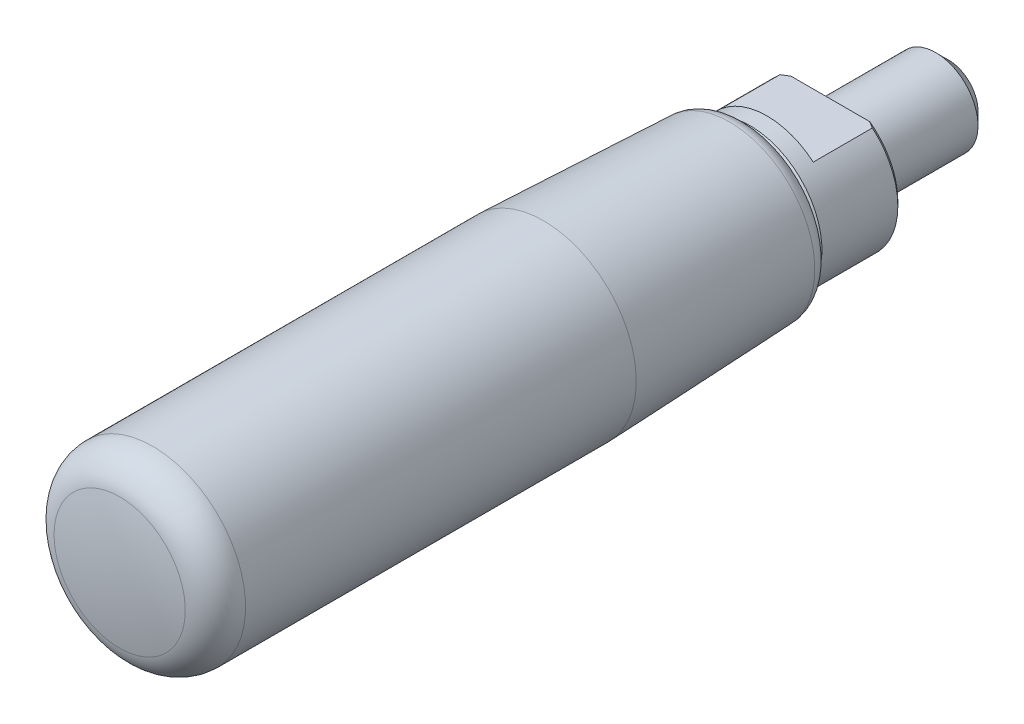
ISO-10303-21;
HEADER;
FILE_DESCRIPTION(('STEP AP214'),'2;1');
FILE_NAME('part.step','',(''),(''),'','','');
FILE_SCHEMA(('AUTOMOTIVE_DESIGN { 1 0 10303 214 1 1 1 1 }'));
ENDSEC;
DATA;
#1=APPLICATION_CONTEXT('core data for automotive mechanical design processes');
#2=APPLICATION_PROTOCOL_DEFINITION('international standard','automotive_design',2000,#1);
#3=PRODUCT_CONTEXT('',#1,'mechanical');
#4=PRODUCT('Part','Part','',(#3));
#5=PRODUCT_RELATED_PRODUCT_CATEGORY('part','',(#4));
#6=PRODUCT_DEFINITION_FORMATION('','',#4);
#7=PRODUCT_DEFINITION_CONTEXT('part definition',#1,'design');
#8=PRODUCT_DEFINITION('design','',#6,#7);
#9=PRODUCT_DEFINITION_SHAPE('','',#8);
#10=(LENGTH_UNIT() NAMED_UNIT(*) SI_UNIT(.MILLI.,.METRE.));
#11=(NAMED_UNIT(*) PLANE_ANGLE_UNIT() SI_UNIT($,.RADIAN.));
#12=(NAMED_UNIT(*) SI_UNIT($,.STERADIAN.) SOLID_ANGLE_UNIT());
#13=UNCERTAINTY_MEASURE_WITH_UNIT(LENGTH_MEASURE(1.E-05),#10,'distance_accuracy_value','');
#14=(GEOMETRIC_REPRESENTATION_CONTEXT(3) GLOBAL_UNCERTAINTY_ASSIGNED_CONTEXT((#13)) GLOBAL_UNIT_ASSIGNED_CONTEXT((#10,
#11,#12)) REPRESENTATION_CONTEXT('',''));
#15=CARTESIAN_POINT('',(0.,0.,0.));
#16=DIRECTION('',(0.,0.,1.));
#17=DIRECTION('',(1.,0.,0.));
#18=AXIS2_PLACEMENT_3D('',#15,#16,#17);
#19=CARTESIAN_POINT('',(0.,0.,-19.));
#20=DIRECTION('',(0.,0.,-1.));
#21=DIRECTION('',(-1.,0.,0.));
#22=AXIS2_PLACEMENT_3D('',#19,#20,#21);
#23=CYLINDRICAL_SURFACE('',#22,8.5);
#24=CARTESIAN_POINT('',(0.,0.,9.5));
#25=DIRECTION('',(0.,0.,-1.));
#26=DIRECTION('',(-1.,0.,0.));
#27=AXIS2_PLACEMENT_3D('',#24,#25,#26);
#28=CIRCLE('',#27,8.5);
#29=CARTESIAN_POINT('',(-8.49999999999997,0.,9.50000000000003));
#30=VERTEX_POINT('',#29);
#31=EDGE_CURVE('E113',#30,#30,#28,.T.);
#32=ORIENTED_EDGE('',*,*,#31,.T.);
#33=EDGE_LOOP('',(#32));
#34=FACE_BOUND('',#33,.T.);
#35=CARTESIAN_POINT('',(0.,0.,0.5));
#36=DIRECTION('',(0.,0.,-1.));
#37=DIRECTION('',(-1.,0.,0.));
#38=AXIS2_PLACEMENT_3D('',#35,#36,#37);
#39=CIRCLE('',#38,8.5);
#40=CARTESIAN_POINT('',(-5.47722557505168,-6.5,0.500000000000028));
#41=VERTEX_POINT('',#40);
#42=CARTESIAN_POINT('',(-5.47722557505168,6.5,0.500000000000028));
#43=VERTEX_POINT('',#42);
#44=EDGE_CURVE('E118',#41,#43,#39,.T.);
#45=ORIENTED_EDGE('',*,*,#44,.F.);
#46=DIRECTION('',(0.,0.,-1.));
#47=VECTOR('',#46,1.);
#48=CARTESIAN_POINT('',(-5.47722557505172,-6.5,-19.));
#49=LINE('',#48,#47);
#50=CARTESIAN_POINT('',(-5.47722557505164,-6.5,7.5));
#51=VERTEX_POINT('',#50);
#52=EDGE_CURVE('E78',#41,#51,#49,.F.);
#53=ORIENTED_EDGE('',*,*,#52,.T.);
#54=CARTESIAN_POINT('',(0.,0.,7.5));
#55=DIRECTION('',(0.,0.,1.));
#56=DIRECTION('',(1.,0.,0.));
#57=AXIS2_PLACEMENT_3D('',#54,#55,#56);
#58=CIRCLE('',#57,8.5);
#59=CARTESIAN_POINT('',(5.47722557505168,-6.5,7.5));
#60=VERTEX_POINT('',#59);
#61=EDGE_CURVE('E82',#60,#51,#58,.F.);
#62=ORIENTED_EDGE('',*,*,#61,.F.);
#63=DIRECTION('',(0.,0.,-1.));
#64=VECTOR('',#63,1.);
#65=CARTESIAN_POINT('',(5.4772255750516,-6.5,-19.));
#66=LINE('',#65,#64);
#67=CARTESIAN_POINT('',(5.47722557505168,-6.5,0.499999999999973));
#68=VERTEX_POINT('',#67);
#69=EDGE_CURVE('E67',#60,#68,#66,.T.);
#70=ORIENTED_EDGE('',*,*,#69,.T.);
#71=CARTESIAN_POINT('',(5.47722557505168,6.5,0.499999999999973));
#72=VERTEX_POINT('',#71);
#73=EDGE_CURVE('E116',#72,#68,#39,.T.);
#74=ORIENTED_EDGE('',*,*,#73,.F.);
#75=DIRECTION('',(0.,0.,-1.));
#76=VECTOR('',#75,1.);
#77=CARTESIAN_POINT('',(5.4772255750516,6.5,-19.));
#78=LINE('',#77,#76);
#79=CARTESIAN_POINT('',(5.47722557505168,6.5,7.5));
#80=VERTEX_POINT('',#79);
#81=EDGE_CURVE('E128',#80,#72,#78,.T.);
#82=ORIENTED_EDGE('',*,*,#81,.F.);
#83=CARTESIAN_POINT('',(0.,0.,7.5));
#84=DIRECTION('',(0.,0.,-1.));
#85=DIRECTION('',(-1.,0.,0.));
#86=AXIS2_PLACEMENT_3D('',#83,#84,#85);
#87=CIRCLE('',#86,8.5);
#88=CARTESIAN_POINT('',(-5.47722557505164,6.5,7.5));
#89=VERTEX_POINT('',#88);
#90=EDGE_CURVE('E88',#80,#89,#87,.F.);
#91=ORIENTED_EDGE('',*,*,#90,.T.);
#92=DIRECTION('',(0.,0.,-1.));
#93=VECTOR('',#92,1.);
#94=CARTESIAN_POINT('',(-5.47722557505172,6.5,-19.));
#95=LINE('',#94,#93);
#96=EDGE_CURVE('E126',#43,#89,#95,.F.);
#97=ORIENTED_EDGE('',*,*,#96,.F.);
#98=EDGE_LOOP('',(#45,#53,#62,#70,#74,#82,#91,#97));
#99=FACE_BOUND('',#98,.T.);
#100=ADVANCED_FACE('F14',(#34,#99),#23,.T.);
#101=CARTESIAN_POINT('',(0.,0.,0.5));
#102=DIRECTION('',(0.,0.,1.));
#103=DIRECTION('',(1.,0.,0.));
#104=AXIS2_PLACEMENT_3D('',#101,#102,#103);
#105=CONICAL_SURFACE('',#104,8.5,0.785398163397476);
#106=CARTESIAN_POINT('',(2.1470979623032,-6.5,-1.15456139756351));
#107=CARTESIAN_POINT('',(2.32011125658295,-6.5,-1.10028095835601));
#108=CARTESIAN_POINT('',(2.49136126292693,-6.5,-1.04066633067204));
#109=CARTESIAN_POINT('',(2.83024122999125,-6.5,-0.912289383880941));
#110=CARTESIAN_POINT('',(2.99787420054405,-6.5,-0.84353504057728));
#111=CARTESIAN_POINT('',(3.32910847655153,-6.5,-0.698570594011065));
#112=CARTESIAN_POINT('',(3.49272247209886,-6.5,-0.622389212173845));
#113=CARTESIAN_POINT('',(3.81680773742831,-6.5,-0.463549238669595));
#114=CARTESIAN_POINT('',(3.9772782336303,-6.5,-0.380889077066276));
#115=CARTESIAN_POINT('',(4.45207454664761,-6.5,-0.126006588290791));
#116=CARTESIAN_POINT('',(4.76212657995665,-6.5,0.0541773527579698));
#117=CARTESIAN_POINT('',(5.3731437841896,-6.5,0.429866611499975));
#118=CARTESIAN_POINT('',(5.6740980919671,-6.5,0.625389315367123));
#119=CARTESIAN_POINT('',(6.1491269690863,-6.5,0.946770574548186));
#120=CARTESIAN_POINT('',(6.32562450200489,-6.5,1.06907697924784));
#121=CARTESIAN_POINT('',(6.67625920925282,-6.5,1.31703136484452));
#122=CARTESIAN_POINT('',(6.85039634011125,-6.5,1.44267940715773));
#123=CARTESIAN_POINT('',(7.36977452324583,-6.5,1.82385228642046));
#124=CARTESIAN_POINT('',(7.71193535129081,-6.5,2.08357365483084));
#125=CARTESIAN_POINT('',(8.39004451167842,-6.5,2.61120239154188));
#126=CARTESIAN_POINT('',(8.72599049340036,-6.5,2.87911275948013));
#127=CARTESIAN_POINT('',(9.39294734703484,-6.5,3.42101971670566));
#128=CARTESIAN_POINT('',(9.72395802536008,-6.5,3.6950165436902));
#129=CARTESIAN_POINT('',(10.3877110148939,-6.5,4.25240968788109));
#130=CARTESIAN_POINT('',(10.7203854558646,-6.5,4.53588661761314));
#131=CARTESIAN_POINT('',(11.3825001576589,-6.5,5.10660843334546));
#132=CARTESIAN_POINT('',(11.7119403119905,-6.5,5.39385344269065));
#133=CARTESIAN_POINT('',(12.3675196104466,-6.5,5.97072932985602));
#134=CARTESIAN_POINT('',(12.6936641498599,-6.5,6.26035408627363));
#135=CARTESIAN_POINT('',(13.3437591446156,-6.5,6.84200684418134));
#136=CARTESIAN_POINT('',(13.6677097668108,-6.5,7.13403465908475));
#137=CARTESIAN_POINT('',(13.9907991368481,-6.5,7.42700426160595));
#138=B_SPLINE_CURVE_WITH_KNOTS('',3,(#106,#107,#108,#109,#110,#111,#112,#113,#114,#115,#116,
#117,#118,#119,#120,#121,#122,#123,#124,#125,#126,#127,#128,#129,#130,#131,#132,#133,#134,#135,
#136,#137),.UNSPECIFIED.,.F.,.F.,(4,2,2,2,2,2,2,2,2,2,2,2,2,2,2,4),(0.,0.543774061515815,
1.08707667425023,1.62835584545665,2.16976658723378,3.24489626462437,4.32126269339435,
4.96542355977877,5.60959627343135,6.89811259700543,8.18710669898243,9.47615122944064,
10.787330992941,12.0985537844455,13.4070800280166,14.7155056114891),.UNSPECIFIED.);
#139=CARTESIAN_POINT('',(4.66368952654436,-6.5,0.));
#140=VERTEX_POINT('',#139);
#141=EDGE_CURVE('E73',#140,#68,#138,.T.);
#142=ORIENTED_EDGE('',*,*,#141,.F.);
#143=CARTESIAN_POINT('',(0.,0.,0.));
#144=DIRECTION('',(0.,0.,-1.));
#145=DIRECTION('',(-1.,0.,0.));
#146=AXIS2_PLACEMENT_3D('',#143,#144,#145);
#147=CIRCLE('',#146,8.);
#148=CARTESIAN_POINT('',(4.66368952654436,6.5,0.));
#149=VERTEX_POINT('',#148);
#150=EDGE_CURVE('E119',#149,#140,#147,.T.);
#151=ORIENTED_EDGE('',*,*,#150,.F.);
#152=CARTESIAN_POINT('',(2.1470979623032,6.5,-1.15456139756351));
#153=CARTESIAN_POINT('',(2.32011125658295,6.5,-1.10028095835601));
#154=CARTESIAN_POINT('',(2.49136126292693,6.5,-1.04066633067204));
#155=CARTESIAN_POINT('',(2.83024122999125,6.5,-0.912289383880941));
#156=CARTESIAN_POINT('',(2.99787420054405,6.5,-0.84353504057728));
#157=CARTESIAN_POINT('',(3.32910847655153,6.5,-0.698570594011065));
#158=CARTESIAN_POINT('',(3.49272247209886,6.5,-0.622389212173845));
#159=CARTESIAN_POINT('',(3.81680773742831,6.5,-0.463549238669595));
#160=CARTESIAN_POINT('',(3.9772782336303,6.5,-0.380889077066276));
#161=CARTESIAN_POINT('',(4.45207454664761,6.5,-0.126006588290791));
#162=CARTESIAN_POINT('',(4.76212657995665,6.5,0.0541773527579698));
#163=CARTESIAN_POINT('',(5.3731437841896,6.5,0.429866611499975));
#164=CARTESIAN_POINT('',(5.6740980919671,6.5,0.625389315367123));
#165=CARTESIAN_POINT('',(6.1491269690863,6.5,0.946770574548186));
#166=CARTESIAN_POINT('',(6.32562450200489,6.5,1.06907697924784));
#167=CARTESIAN_POINT('',(6.67625920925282,6.5,1.31703136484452));
#168=CARTESIAN_POINT('',(6.85039634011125,6.5,1.44267940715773));
#169=CARTESIAN_POINT('',(7.36977452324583,6.5,1.82385228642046));
#170=CARTESIAN_POINT('',(7.71193535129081,6.5,2.08357365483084));
#171=CARTESIAN_POINT('',(8.39004451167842,6.5,2.61120239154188));
#172=CARTESIAN_POINT('',(8.72599049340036,6.5,2.87911275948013));
#173=CARTESIAN_POINT('',(9.39294734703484,6.5,3.42101971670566));
#174=CARTESIAN_POINT('',(9.72395802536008,6.5,3.6950165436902));
#175=CARTESIAN_POINT('',(10.3877110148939,6.5,4.25240968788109));
#176=CARTESIAN_POINT('',(10.7203854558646,6.5,4.53588661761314));
#177=CARTESIAN_POINT('',(11.3825001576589,6.5,5.10660843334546));
#178=CARTESIAN_POINT('',(11.7119403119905,6.5,5.39385344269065));
#179=CARTESIAN_POINT('',(12.3675196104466,6.5,5.97072932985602));
#180=CARTESIAN_POINT('',(12.6936641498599,6.5,6.26035408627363));
#181=CARTESIAN_POINT('',(13.3437591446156,6.5,6.84200684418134));
#182=CARTESIAN_POINT('',(13.6677097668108,6.5,7.13403465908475));
#183=CARTESIAN_POINT('',(13.9907991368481,6.5,7.42700426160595));
#184=B_SPLINE_CURVE_WITH_KNOTS('',3,(#152,#153,#154,#155,#156,#157,#158,#159,#160,#161,#162,
#163,#164,#165,#166,#167,#168,#169,#170,#171,#172,#173,#174,#175,#176,#177,#178,#179,#180,#181,
#182,#183),.UNSPECIFIED.,.F.,.F.,(4,2,2,2,2,2,2,2,2,2,2,2,2,2,2,4),(0.,0.543774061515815,
1.08707667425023,1.62835584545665,2.16976658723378,3.24489626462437,4.32126269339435,
4.96542355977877,5.60959627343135,6.89811259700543,8.18710669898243,9.47615122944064,
10.787330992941,12.0985537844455,13.4070800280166,14.7155056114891),.UNSPECIFIED.);
#185=EDGE_CURVE('E37',#149,#72,#184,.T.);
#186=ORIENTED_EDGE('',*,*,#185,.T.);
#187=ORIENTED_EDGE('',*,*,#73,.T.);
#188=EDGE_LOOP('',(#142,#151,#186,#187));
#189=FACE_BOUND('',#188,.T.);
#190=ADVANCED_FACE('F143',(#189),#105,.T.);
#191=CARTESIAN_POINT('',(-13.9907991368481,-6.5,7.427004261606));
#192=CARTESIAN_POINT('',(-13.6677097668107,-6.5,7.13403465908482));
#193=CARTESIAN_POINT('',(-13.3437591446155,-6.5,6.84200684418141));
#194=CARTESIAN_POINT('',(-12.6936641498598,-6.5,6.2603540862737));
#195=CARTESIAN_POINT('',(-12.3675196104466,-6.5,5.97072932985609));
#196=CARTESIAN_POINT('',(-11.7119403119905,-6.5,5.39385344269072));
#197=CARTESIAN_POINT('',(-11.3825001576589,-6.5,5.10660843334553));
#198=CARTESIAN_POINT('',(-10.7203854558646,-6.5,4.53588661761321));
#199=CARTESIAN_POINT('',(-10.3877110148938,-6.5,4.25240968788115));
#200=CARTESIAN_POINT('',(-9.72395802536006,-6.5,3.69501654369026));
#201=CARTESIAN_POINT('',(-9.39294734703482,-6.5,3.42101971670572));
#202=CARTESIAN_POINT('',(-8.72599049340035,-6.5,2.87911275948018));
#203=CARTESIAN_POINT('',(-8.39004451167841,-6.5,2.61120239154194));
#204=CARTESIAN_POINT('',(-7.71193535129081,-6.5,2.08357365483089));
#205=CARTESIAN_POINT('',(-7.36977452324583,-6.5,1.82385228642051));
#206=CARTESIAN_POINT('',(-6.85039634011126,-6.5,1.44267940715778));
#207=CARTESIAN_POINT('',(-6.67625920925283,-6.5,1.31703136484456));
#208=CARTESIAN_POINT('',(-6.3256245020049,-6.5,1.06907697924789));
#209=CARTESIAN_POINT('',(-6.14912696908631,-6.5,0.946770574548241));
#210=CARTESIAN_POINT('',(-5.67409809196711,-6.5,0.625389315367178));
#211=CARTESIAN_POINT('',(-5.37314378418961,-6.5,0.42986661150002));
#212=CARTESIAN_POINT('',(-4.76212657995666,-6.5,0.0541773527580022));
#213=CARTESIAN_POINT('',(-4.45207454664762,-6.5,-0.12600658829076));
#214=CARTESIAN_POINT('',(-3.97727823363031,-6.5,-0.380889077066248));
#215=CARTESIAN_POINT('',(-3.81680773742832,-6.5,-0.463549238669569));
#216=CARTESIAN_POINT('',(-3.49272247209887,-6.5,-0.622389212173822));
#217=CARTESIAN_POINT('',(-3.32910847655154,-6.5,-0.698570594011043));
#218=CARTESIAN_POINT('',(-2.99787420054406,-6.5,-0.843535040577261));
#219=CARTESIAN_POINT('',(-2.83024122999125,-6.5,-0.912289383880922));
#220=CARTESIAN_POINT('',(-2.49136126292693,-6.5,-1.04066633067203));
#221=CARTESIAN_POINT('',(-2.32011125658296,-6.5,-1.100280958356));
#222=CARTESIAN_POINT('',(-2.14709796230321,-6.5,-1.15456139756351));
#223=B_SPLINE_CURVE_WITH_KNOTS('',3,(#191,#192,#193,#194,#195,#196,#197,#198,#199,#200,#201,
#202,#203,#204,#205,#206,#207,#208,#209,#210,#211,#212,#213,#214,#215,#216,#217,#218,#219,#220,
#221,#222),.UNSPECIFIED.,.F.,.F.,(4,2,2,2,2,2,2,2,2,2,2,2,2,2,2,4),(0.,1.30842558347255,
2.61695182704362,3.92817461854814,5.23935438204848,6.5283989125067,7.81739301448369,
9.10590933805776,9.75008205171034,10.3942429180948,11.4706093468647,12.5457390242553,
13.0871497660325,13.6284289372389,14.1717315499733,14.7155056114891),.UNSPECIFIED.);
#224=CARTESIAN_POINT('',(-4.66368952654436,-6.5,0.));
#225=VERTEX_POINT('',#224);
#226=EDGE_CURVE('E29',#41,#225,#223,.T.);
#227=ORIENTED_EDGE('',*,*,#226,.F.);
#228=ORIENTED_EDGE('',*,*,#44,.T.);
#229=CARTESIAN_POINT('',(-13.9907991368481,6.5,7.427004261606));
#230=CARTESIAN_POINT('',(-13.6677097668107,6.5,7.13403465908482));
#231=CARTESIAN_POINT('',(-13.3437591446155,6.5,6.84200684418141));
#232=CARTESIAN_POINT('',(-12.6936641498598,6.5,6.2603540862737));
#233=CARTESIAN_POINT('',(-12.3675196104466,6.5,5.97072932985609));
#234=CARTESIAN_POINT('',(-11.7119403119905,6.5,5.39385344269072));
#235=CARTESIAN_POINT('',(-11.3825001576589,6.5,5.10660843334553));
#236=CARTESIAN_POINT('',(-10.7203854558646,6.5,4.53588661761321));
#237=CARTESIAN_POINT('',(-10.3877110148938,6.5,4.25240968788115));
#238=CARTESIAN_POINT('',(-9.72395802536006,6.5,3.69501654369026));
#239=CARTESIAN_POINT('',(-9.39294734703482,6.5,3.42101971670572));
#240=CARTESIAN_POINT('',(-8.72599049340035,6.5,2.87911275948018));
#241=CARTESIAN_POINT('',(-8.39004451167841,6.5,2.61120239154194));
#242=CARTESIAN_POINT('',(-7.71193535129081,6.5,2.08357365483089));
#243=CARTESIAN_POINT('',(-7.36977452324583,6.5,1.82385228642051));
#244=CARTESIAN_POINT('',(-6.85039634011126,6.5,1.44267940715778));
#245=CARTESIAN_POINT('',(-6.67625920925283,6.5,1.31703136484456));
#246=CARTESIAN_POINT('',(-6.3256245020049,6.5,1.06907697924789));
#247=CARTESIAN_POINT('',(-6.14912696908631,6.5,0.946770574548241));
#248=CARTESIAN_POINT('',(-5.67409809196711,6.5,0.625389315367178));
#249=CARTESIAN_POINT('',(-5.37314378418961,6.5,0.42986661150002));
#250=CARTESIAN_POINT('',(-4.76212657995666,6.5,0.0541773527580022));
#251=CARTESIAN_POINT('',(-4.45207454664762,6.5,-0.12600658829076));
#252=CARTESIAN_POINT('',(-3.97727823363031,6.5,-0.380889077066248));
#253=CARTESIAN_POINT('',(-3.81680773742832,6.5,-0.463549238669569));
#254=CARTESIAN_POINT('',(-3.49272247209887,6.5,-0.622389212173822));
#255=CARTESIAN_POINT('',(-3.32910847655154,6.5,-0.698570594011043));
#256=CARTESIAN_POINT('',(-2.99787420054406,6.5,-0.843535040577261));
#257=CARTESIAN_POINT('',(-2.83024122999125,6.5,-0.912289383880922));
#258=CARTESIAN_POINT('',(-2.49136126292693,6.5,-1.04066633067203));
#259=CARTESIAN_POINT('',(-2.32011125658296,6.5,-1.100280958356));
#260=CARTESIAN_POINT('',(-2.14709796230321,6.5,-1.15456139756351));
#261=B_SPLINE_CURVE_WITH_KNOTS('',3,(#229,#230,#231,#232,#233,#234,#235,#236,#237,#238,#239,
#240,#241,#242,#243,#244,#245,#246,#247,#248,#249,#250,#251,#252,#253,#254,#255,#256,#257,#258,
#259,#260),.UNSPECIFIED.,.F.,.F.,(4,2,2,2,2,2,2,2,2,2,2,2,2,2,2,4),(0.,1.30842558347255,
2.61695182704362,3.92817461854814,5.23935438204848,6.5283989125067,7.81739301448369,
9.10590933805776,9.75008205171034,10.3942429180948,11.4706093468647,12.5457390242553,
13.0871497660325,13.6284289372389,14.1717315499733,14.7155056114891),.UNSPECIFIED.);
#262=CARTESIAN_POINT('',(-4.66368952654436,6.5,0.));
#263=VERTEX_POINT('',#262);
#264=EDGE_CURVE('E137',#43,#263,#261,.T.);
#265=ORIENTED_EDGE('',*,*,#264,.T.);
#266=EDGE_CURVE('E122',#225,#263,#147,.T.);
#267=ORIENTED_EDGE('',*,*,#266,.F.);
#268=EDGE_LOOP('',(#227,#228,#265,#267));
#269=FACE_BOUND('',#268,.T.);
#270=ADVANCED_FACE('F162',(#269),#105,.T.);
#271=CARTESIAN_POINT('',(0.,5.,0.));
#272=DIRECTION('',(0.,0.,-1.));
#273=DIRECTION('',(-1.,0.,0.));
#274=AXIS2_PLACEMENT_3D('',#271,#272,#273);
#275=PLANE('',#274);
#276=CARTESIAN_POINT('',(0.,0.,0.));
#277=DIRECTION('',(0.,0.,-1.));
#278=DIRECTION('',(-1.,0.,0.));
#279=AXIS2_PLACEMENT_3D('',#276,#277,#278);
#280=CIRCLE('',#279,5.);
#281=CARTESIAN_POINT('',(-5.,0.,0.));
#282=VERTEX_POINT('',#281);
#283=EDGE_CURVE('E123',#282,#282,#280,.T.);
#284=ORIENTED_EDGE('',*,*,#283,.F.);
#285=EDGE_LOOP('',(#284));
#286=FACE_BOUND('',#285,.T.);
#287=ORIENTED_EDGE('',*,*,#150,.T.);
#288=DIRECTION('',(-1.,0.,0.));
#289=VECTOR('',#288,1.);
#290=CARTESIAN_POINT('',(0.,-6.5,0.));
#291=LINE('',#290,#289);
#292=EDGE_CURVE('E85',#140,#225,#291,.T.);
#293=ORIENTED_EDGE('',*,*,#292,.T.);
#294=ORIENTED_EDGE('',*,*,#266,.T.);
#295=DIRECTION('',(-1.,0.,0.));
#296=VECTOR('',#295,1.);
#297=CARTESIAN_POINT('',(0.,6.5,0.));
#298=LINE('',#297,#296);
#299=EDGE_CURVE('E93',#149,#263,#298,.T.);
#300=ORIENTED_EDGE('',*,*,#299,.F.);
#301=EDGE_LOOP('',(#287,#293,#294,#300));
#302=FACE_BOUND('',#301,.T.);
#303=ADVANCED_FACE('F159',(#286,#302),#275,.T.);
#304=CARTESIAN_POINT('',(0.,0.,-19.));
#305=DIRECTION('',(0.,0.,-1.));
#306=DIRECTION('',(-1.,0.,0.));
#307=AXIS2_PLACEMENT_3D('',#304,#305,#306);
#308=CYLINDRICAL_SURFACE('',#307,5.);
#309=CARTESIAN_POINT('',(0.,0.,-12.5));
#310=DIRECTION('',(0.,0.,-1.));
#311=DIRECTION('',(-1.,0.,0.));
#312=AXIS2_PLACEMENT_3D('',#309,#310,#311);
#313=CIRCLE('',#312,5.);
#314=CARTESIAN_POINT('',(-5.00000000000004,0.,-12.5));
#315=VERTEX_POINT('',#314);
#316=EDGE_CURVE('E9',#315,#315,#313,.F.);
#317=ORIENTED_EDGE('',*,*,#316,.T.);
#318=EDGE_LOOP('',(#317));
#319=FACE_BOUND('',#318,.T.);
#320=ORIENTED_EDGE('',*,*,#283,.T.);
#321=EDGE_LOOP('',(#320));
#322=FACE_BOUND('',#321,.T.);
#323=ADVANCED_FACE('F161',(#319,#322),#308,.T.);
#324=CARTESIAN_POINT('',(0.,0.,-14.0000000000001));
#325=DIRECTION('',(0.,0.,-1.));
#326=DIRECTION('',(-1.,0.,0.));
#327=AXIS2_PLACEMENT_3D('',#324,#325,#326);
#328=PLANE('',#327);
#329=CARTESIAN_POINT('',(0.,0.,-14.0000000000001));
#330=DIRECTION('',(0.,0.,-1.));
#331=DIRECTION('',(-1.,0.,0.));
#332=AXIS2_PLACEMENT_3D('',#329,#330,#331);
#333=CIRCLE('',#332,3.5);
#334=CARTESIAN_POINT('',(-3.50000000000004,0.,-14.0000000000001));
#335=VERTEX_POINT('',#334);
#336=EDGE_CURVE('E22',#335,#335,#333,.T.);
#337=ORIENTED_EDGE('',*,*,#336,.T.);
#338=EDGE_LOOP('',(#337));
#339=FACE_BOUND('',#338,.T.);
#340=ADVANCED_FACE('F169',(#339),#328,.T.);
#341=CARTESIAN_POINT('',(1.33821525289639E-13,0.,45.));
#342=DIRECTION('',(-1.,0.,0.));
#343=DIRECTION('',(0.,0.,1.));
#344=AXIS2_PLACEMENT_3D('',#341,#342,#343);
#345=SPHERICAL_SURFACE('',#344,40.);
#346=CARTESIAN_POINT('',(1.33821525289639E-13,0.,45.));
#347=DIRECTION('',(0.,0.,-1.));
#348=DIRECTION('',(-1.,0.,0.));
#349=AXIS2_PLACEMENT_3D('',#346,#347,#348);
#350=SPHERICAL_SURFACE('',#349,40.);
#351=CARTESIAN_POINT('',(2.50503609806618E-13,0.,84.236541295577));
#352=DIRECTION('',(0.,0.,-1.));
#353=DIRECTION('',(-1.,0.,0.));
#354=AXIS2_PLACEMENT_3D('',#351,#352,#353);
#355=CIRCLE('',#354,7.77777777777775);
#356=CARTESIAN_POINT('',(-7.7777777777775,0.,84.236541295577));
#357=VERTEX_POINT('',#356);
#358=EDGE_CURVE('E95',#357,#357,#355,.T.);
#359=ORIENTED_EDGE('',*,*,#358,.F.);
#360=EDGE_LOOP('',(#359));
#361=FACE_BOUND('',#360,.T.);
#362=ADVANCED_FACE('F203',(#361),#350,.T.);
#363=CARTESIAN_POINT('',(2.38835401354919E-13,0.,80.312887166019));
#364=DIRECTION('',(0.,0.,-1.));
#365=DIRECTION('',(-1.,0.,0.));
#366=AXIS2_PLACEMENT_3D('',#363,#364,#365);
#367=TOROIDAL_SURFACE('',#366,7.,4.);
#368=CARTESIAN_POINT('',(2.38835401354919E-13,0.,80.312887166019));
#369=DIRECTION('',(0.,0.,-1.));
#370=DIRECTION('',(-1.,0.,0.));
#371=AXIS2_PLACEMENT_3D('',#368,#369,#370);
#372=CIRCLE('',#371,11.);
#373=CARTESIAN_POINT('',(-10.9999999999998,0.,80.312887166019));
#374=VERTEX_POINT('',#373);
#375=EDGE_CURVE('E98',#374,#374,#372,.T.);
#376=ORIENTED_EDGE('',*,*,#375,.F.);
#377=EDGE_LOOP('',(#376));
#378=FACE_BOUND('',#377,.T.);
#379=ORIENTED_EDGE('',*,*,#358,.T.);
#380=EDGE_LOOP('',(#379));
#381=FACE_BOUND('',#380,.T.);
#382=ADVANCED_FACE('F199',(#378,#381),#367,.T.);
#383=CARTESIAN_POINT('',(0.,0.,-19.));
#384=DIRECTION('',(0.,0.,-1.));
#385=DIRECTION('',(-1.,0.,0.));
#386=AXIS2_PLACEMENT_3D('',#383,#384,#385);
#387=CYLINDRICAL_SURFACE('',#386,11.);
#388=CARTESIAN_POINT('',(1.01109596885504E-13,0.,33.9999999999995));
#389=DIRECTION('',(0.,0.,-1.));
#390=DIRECTION('',(-1.,0.,0.));
#391=AXIS2_PLACEMENT_3D('',#388,#389,#390);
#392=CIRCLE('',#391,11.);
#393=CARTESIAN_POINT('',(-10.9999999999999,0.,33.9999999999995));
#394=VERTEX_POINT('',#393);
#395=EDGE_CURVE('E101',#394,#394,#392,.T.);
#396=ORIENTED_EDGE('',*,*,#395,.F.);
#397=EDGE_LOOP('',(#396));
#398=FACE_BOUND('',#397,.T.);
#399=ORIENTED_EDGE('',*,*,#375,.T.);
#400=EDGE_LOOP('',(#399));
#401=FACE_BOUND('',#400,.T.);
#402=ADVANCED_FACE('F195',(#398,#401),#387,.T.);
#403=CARTESIAN_POINT('',(1.01109596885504E-13,0.,33.9999999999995));
#404=DIRECTION('',(0.,0.,1.));
#405=DIRECTION('',(1.,0.,0.));
#406=AXIS2_PLACEMENT_3D('',#403,#404,#405);
#407=CONICAL_SURFACE('',#406,11.,0.0416425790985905);
#408=CARTESIAN_POINT('',(0.,0.,11.9167389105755));
#409=DIRECTION('',(0.,0.,-1.));
#410=DIRECTION('',(-1.,0.,0.));
#411=AXIS2_PLACEMENT_3D('',#408,#409,#410);
#412=CIRCLE('',#411,10.0798641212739);
#413=CARTESIAN_POINT('',(-10.0798641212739,0.,11.9167389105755));
#414=VERTEX_POINT('',#413);
#415=EDGE_CURVE('E104',#414,#414,#412,.T.);
#416=ORIENTED_EDGE('',*,*,#415,.F.);
#417=EDGE_LOOP('',(#416));
#418=FACE_BOUND('',#417,.T.);
#419=ORIENTED_EDGE('',*,*,#395,.T.);
#420=EDGE_LOOP('',(#419));
#421=FACE_BOUND('',#420,.T.);
#422=ADVANCED_FACE('F191',(#418,#421),#407,.T.);
#423=CARTESIAN_POINT('',(0.,0.,12.));
#424=DIRECTION('',(0.,0.,-1.));
#425=DIRECTION('',(-1.,0.,0.));
#426=AXIS2_PLACEMENT_3D('',#423,#424,#425);
#427=TOROIDAL_SURFACE('',#426,8.08159797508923,2.);
#428=CARTESIAN_POINT('',(0.,0.,10.));
#429=DIRECTION('',(0.,0.,-1.));
#430=DIRECTION('',(-1.,0.,0.));
#431=AXIS2_PLACEMENT_3D('',#428,#429,#430);
#432=CIRCLE('',#431,8.08159797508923);
#433=CARTESIAN_POINT('',(-8.0815979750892,0.,10.));
#434=VERTEX_POINT('',#433);
#435=EDGE_CURVE('E107',#434,#434,#432,.T.);
#436=ORIENTED_EDGE('',*,*,#435,.F.);
#437=EDGE_LOOP('',(#436));
#438=FACE_BOUND('',#437,.T.);
#439=ORIENTED_EDGE('',*,*,#415,.T.);
#440=EDGE_LOOP('',(#439));
#441=FACE_BOUND('',#440,.T.);
#442=ADVANCED_FACE('F187',(#438,#441),#427,.T.);
#443=CARTESIAN_POINT('',(0.,8.,10.));
#444=DIRECTION('',(0.,0.,-1.));
#445=DIRECTION('',(-1.,0.,0.));
#446=AXIS2_PLACEMENT_3D('',#443,#444,#445);
#447=PLANE('',#446);
#448=ORIENTED_EDGE('',*,*,#435,.T.);
#449=EDGE_LOOP('',(#448));
#450=FACE_BOUND('',#449,.T.);
#451=CARTESIAN_POINT('',(0.,0.,10.));
#452=DIRECTION('',(0.,0.,-1.));
#453=DIRECTION('',(-1.,0.,0.));
#454=AXIS2_PLACEMENT_3D('',#451,#452,#453);
#455=CIRCLE('',#454,8.);
#456=CARTESIAN_POINT('',(-7.99999999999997,0.,10.));
#457=VERTEX_POINT('',#456);
#458=EDGE_CURVE('E110',#457,#457,#455,.T.);
#459=ORIENTED_EDGE('',*,*,#458,.F.);
#460=EDGE_LOOP('',(#459));
#461=FACE_BOUND('',#460,.T.);
#462=ADVANCED_FACE('F183',(#450,#461),#447,.T.);
#463=CARTESIAN_POINT('',(0.,0.,9.5));
#464=DIRECTION('',(0.,0.,-1.));
#465=DIRECTION('',(-1.,0.,0.));
#466=AXIS2_PLACEMENT_3D('',#463,#464,#465);
#467=CONICAL_SURFACE('',#466,8.5,0.785398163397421);
#468=ORIENTED_EDGE('',*,*,#458,.T.);
#469=EDGE_LOOP('',(#468));
#470=FACE_BOUND('',#469,.T.);
#471=ORIENTED_EDGE('',*,*,#31,.F.);
#472=EDGE_LOOP('',(#471));
#473=FACE_BOUND('',#472,.T.);
#474=ADVANCED_FACE('F157',(#470,#473),#467,.T.);
#475=CARTESIAN_POINT('',(10.,10.5149149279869,7.5));
#476=DIRECTION('',(0.,0.,-1.));
#477=DIRECTION('',(-1.,0.,0.));
#478=AXIS2_PLACEMENT_3D('',#475,#476,#477);
#479=PLANE('',#478);
#480=DIRECTION('',(-1.,0.,0.));
#481=VECTOR('',#480,1.);
#482=CARTESIAN_POINT('',(10.,6.5,7.5));
#483=LINE('',#482,#481);
#484=EDGE_CURVE('E348',#80,#89,#483,.T.);
#485=ORIENTED_EDGE('',*,*,#484,.T.);
#486=ORIENTED_EDGE('',*,*,#90,.F.);
#487=EDGE_LOOP('',(#485,#486));
#488=FACE_BOUND('',#487,.T.);
#489=ADVANCED_FACE('F152',(#488),#479,.T.);
#490=CARTESIAN_POINT('',(10.,6.5,-2.72975463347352));
#491=DIRECTION('',(0.,-1.,0.));
#492=DIRECTION('',(1.,0.,0.));
#493=AXIS2_PLACEMENT_3D('',#490,#491,#492);
#494=PLANE('',#493);
#495=ORIENTED_EDGE('',*,*,#96,.T.);
#496=ORIENTED_EDGE('',*,*,#484,.F.);
#497=ORIENTED_EDGE('',*,*,#81,.T.);
#498=ORIENTED_EDGE('',*,*,#185,.F.);
#499=ORIENTED_EDGE('',*,*,#299,.T.);
#500=ORIENTED_EDGE('',*,*,#264,.F.);
#501=EDGE_LOOP('',(#495,#496,#497,#498,#499,#500));
#502=FACE_BOUND('',#501,.T.);
#503=ADVANCED_FACE('F147',(#502),#494,.F.);
#504=CARTESIAN_POINT('',(10.,-6.5,-2.72975463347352));
#505=DIRECTION('',(0.,-1.,0.));
#506=DIRECTION('',(1.,0.,0.));
#507=AXIS2_PLACEMENT_3D('',#504,#505,#506);
#508=PLANE('',#507);
#509=ORIENTED_EDGE('',*,*,#226,.T.);
#510=ORIENTED_EDGE('',*,*,#292,.F.);
#511=ORIENTED_EDGE('',*,*,#141,.T.);
#512=ORIENTED_EDGE('',*,*,#69,.F.);
#513=DIRECTION('',(-1.,0.,0.));
#514=VECTOR('',#513,1.);
#515=CARTESIAN_POINT('',(10.,-6.5,7.5));
#516=LINE('',#515,#514);
#517=EDGE_CURVE('E70',#60,#51,#516,.T.);
#518=ORIENTED_EDGE('',*,*,#517,.T.);
#519=ORIENTED_EDGE('',*,*,#52,.F.);
#520=EDGE_LOOP('',(#509,#510,#511,#512,#518,#519));
#521=FACE_BOUND('',#520,.T.);
#522=ADVANCED_FACE('F69',(#521),#508,.T.);
#523=CARTESIAN_POINT('',(10.,-10.5149149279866,7.5));
#524=DIRECTION('',(0.,0.,1.));
#525=DIRECTION('',(1.,0.,0.));
#526=AXIS2_PLACEMENT_3D('',#523,#524,#525);
#527=PLANE('',#526);
#528=ORIENTED_EDGE('',*,*,#61,.T.);
#529=ORIENTED_EDGE('',*,*,#517,.F.);
#530=EDGE_LOOP('',(#528,#529));
#531=FACE_BOUND('',#530,.T.);
#532=ADVANCED_FACE('F81',(#531),#527,.F.);
#533=CARTESIAN_POINT('',(0.,0.,-14.0000000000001));
#534=DIRECTION('',(0.,0.,1.));
#535=DIRECTION('',(1.,0.,0.));
#536=AXIS2_PLACEMENT_3D('',#533,#534,#535);
#537=CONICAL_SURFACE('',#536,3.5,0.785398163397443);
#538=ORIENTED_EDGE('',*,*,#316,.F.);
#539=EDGE_LOOP('',(#538));
#540=FACE_BOUND('',#539,.T.);
#541=ORIENTED_EDGE('',*,*,#336,.F.);
#542=EDGE_LOOP('',(#541));
#543=FACE_BOUND('',#542,.T.);
#544=ADVANCED_FACE('F16',(#540,#543),#537,.T.);
#545=CLOSED_SHELL('',(#100,#190,#270,#303,#323,#340,#362,#382,#402,#422,#442,#462,#474,#489,
#503,#522,#532,#544));
#546=MANIFOLD_SOLID_BREP('B1',#545);
#547=ADVANCED_BREP_SHAPE_REPRESENTATION('',(#18,#546),#14);
#548=SHAPE_DEFINITION_REPRESENTATION(#9,#547);
ENDSEC;
END-ISO-10303-21;
